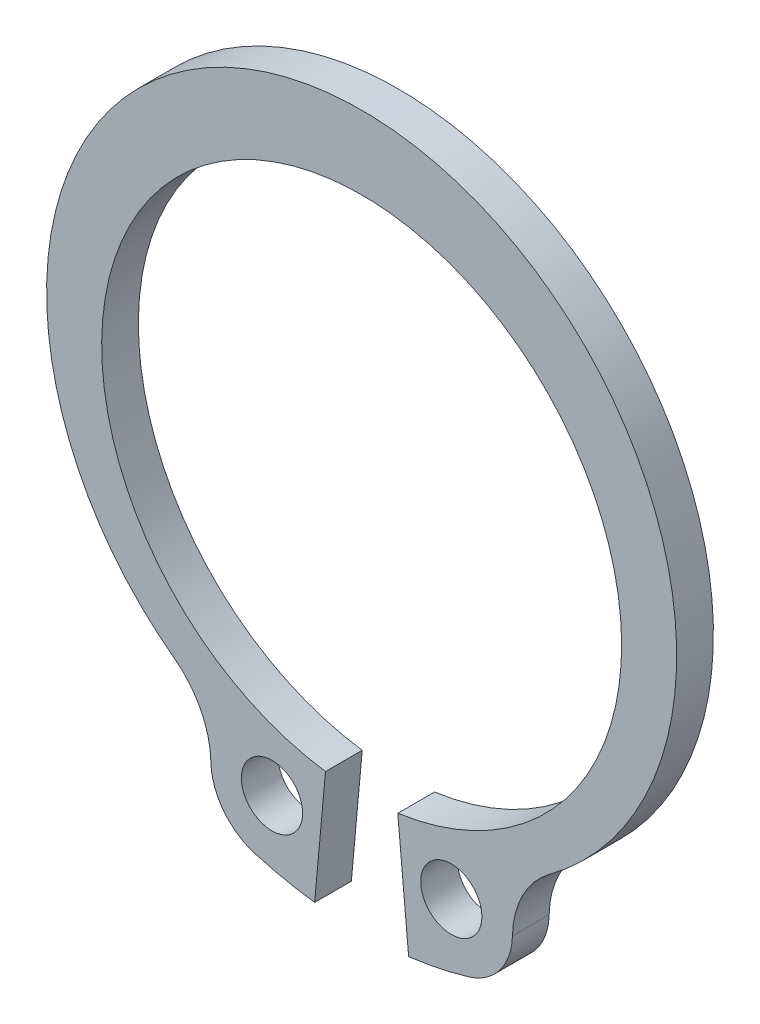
from build123d import *

# Parameters (mm, degrees)
ESQUISSE1_R          = 1
BASE_EXTRUSION_DEPTH = 1.2


with BuildPart() as part:
    # Esquisse1 → Base-Extrusion (new body)
    with BuildSketch(Plane.XY):
        with BuildLine():
            Line((1.18171485, -8.417455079), (1.536021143, -12.301327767))
            ThreePointArc((1.536021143, -12.301327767), (2.523332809, -12.137331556), (3.494197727, -11.894225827))
            ThreePointArc((3.494197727, -11.894225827), (4.519277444, -11.190101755), (4.930054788, -10.016286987))
            ThreePointArc((4.930054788, -10.016286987), (5.263282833, -8.702358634), (6.140833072, -7.669230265))
            ThreePointArc((6.140833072, -7.669230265), (0, 10.9), (-6.140833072, -7.669230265))
            ThreePointArc((-6.140833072, -7.669230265), (-5.263282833, -8.702358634), (-4.930054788, -10.016286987))
            ThreePointArc((-4.930054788, -10.016286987), (-4.519277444, -11.190101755), (-3.494197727, -11.894225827))
            ThreePointArc((-3.494197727, -11.894225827), (-2.523332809, -12.137331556), (-1.536021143, -12.301327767))
            Line((-1.536021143, -12.301327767), (-1.18171485, -8.417455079))
            ThreePointArc((-1.18171485, -8.417455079), (0, 8.5), (1.18171485, -8.417455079))
        make_face()
        with Locations((2.930474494, -9.975315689)):
            Circle(ESQUISSE1_R, mode=Mode.SUBTRACT)
        with Locations(Location((-2.930474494, -9.975315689, 0), (0, 0, 180))):
            Circle(ESQUISSE1_R, mode=Mode.SUBTRACT)
    extrude(amount=BASE_EXTRUSION_DEPTH)


solid = part.part
